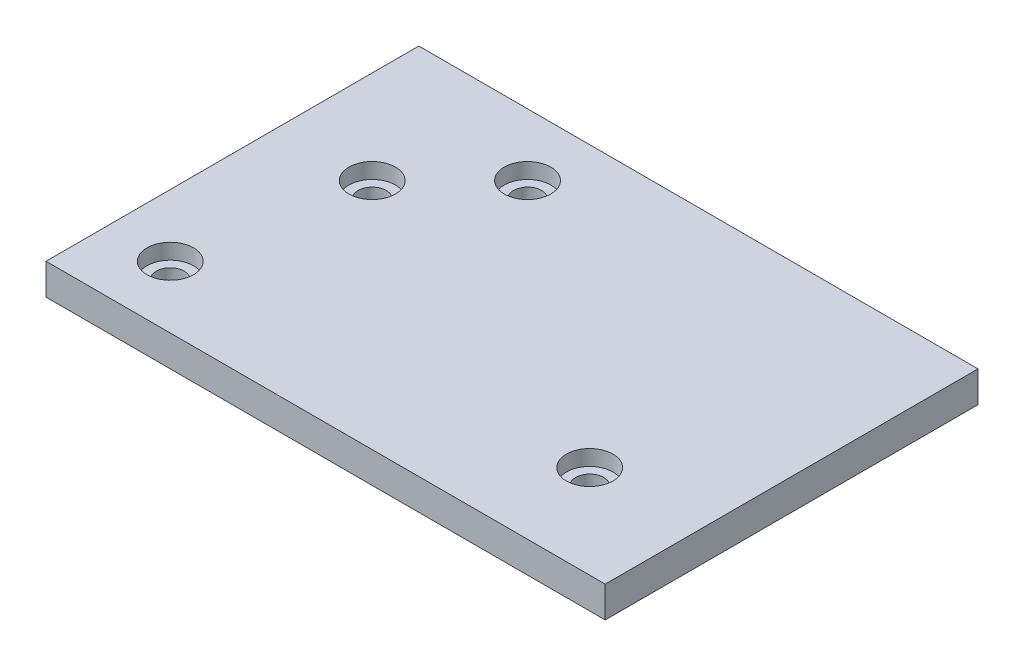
from build123d import *

# Parameters (mm, degrees)
SKETCH1_W          = 180
SKETCH1_H          = 120
EXTRUDE1_DEPTH     = 5
CUT_EXTRUDE1_REACH = 110.628
SKETCH2_R          = 4.5
SKETCH3_R          = 7.5
CUT_EXTRUDE2_DEPTH = 5


with BuildPart() as part:
    # Sketch1 → Extrude1 (new, symmetric)
    with BuildSketch(Plane(origin=(0, 0, 0), x_dir=(1, 0, 0), z_dir=(0, 1, 0))):
        Rectangle(SKETCH1_W, SKETCH1_H)
    extrude(amount=EXTRUDE1_DEPTH, both=True)

    # Sketch2 → Cut-Extrude1 (cut, up to next)
    with BuildSketch(Plane(origin=(0, 5, 0), x_dir=(-1, 0, 0), z_dir=(0, 1, 0)), mode=Mode.PRIVATE) as cut_extrude1_sk1:
        with Locations(Location((70, 40, 0), (0, 0, 90))):
            Circle(SKETCH2_R)
    cut_extrude1_tool1 = extrude(cut_extrude1_sk1.sketch, amount=-CUT_EXTRUDE1_REACH, mode=Mode.PRIVATE) & part.part
    cut_extrude1 = cut_extrude1_tool1.solids().sort_by_distance((-70, 5, 40))[0]
    add(cut_extrude1, mode=Mode.SUBTRACT)

    # Sketch3 → Cut-Extrude2 (cut)
    with BuildSketch(Plane(origin=(0, 5, 0), x_dir=(-1, 0, 0), z_dir=(0, 1, 0))):
        with Locations(Location((70, 40, 0), (0, 0, 90))):
            Circle(SKETCH3_R)
    cut_extrude2 = extrude(amount=-CUT_EXTRUDE2_DEPTH, mode=Mode.SUBTRACT)

    # Sketch-Pattern1: Cut-Extrude1, Cut-Extrude2 at 3 more places
    with Locations((10, 0, -55), (35, 0, -80), (125, 0, -10)):
        add(cut_extrude1, mode=Mode.SUBTRACT)
        add(cut_extrude2, mode=Mode.SUBTRACT)


solid = part.part
